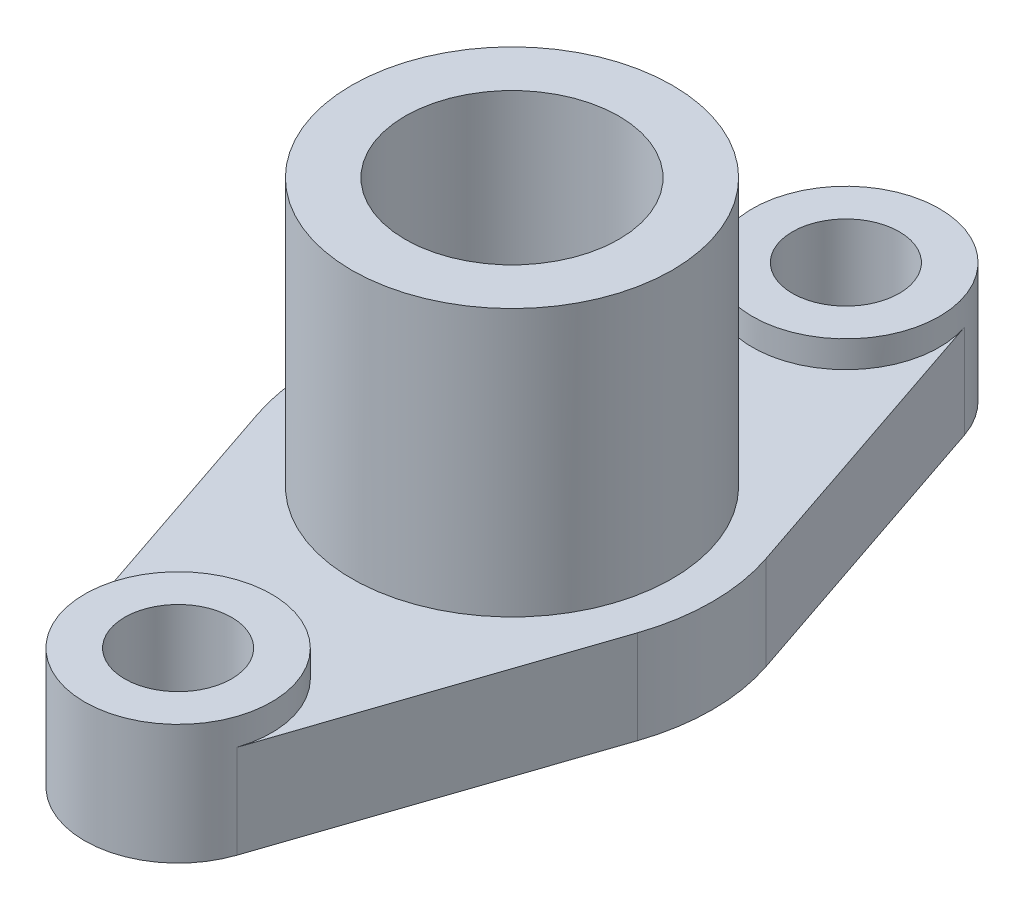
ISO-10303-21;
HEADER;
FILE_DESCRIPTION(('STEP AP214'),'2;1');
FILE_NAME('part.step','',(''),(''),'','','');
FILE_SCHEMA(('AUTOMOTIVE_DESIGN { 1 0 10303 214 1 1 1 1 }'));
ENDSEC;
DATA;
#1=APPLICATION_CONTEXT('core data for automotive mechanical design processes');
#2=APPLICATION_PROTOCOL_DEFINITION('international standard','automotive_design',2000,#1);
#3=PRODUCT_CONTEXT('',#1,'mechanical');
#4=PRODUCT('Part','Part','',(#3));
#5=PRODUCT_RELATED_PRODUCT_CATEGORY('part','',(#4));
#6=PRODUCT_DEFINITION_FORMATION('','',#4);
#7=PRODUCT_DEFINITION_CONTEXT('part definition',#1,'design');
#8=PRODUCT_DEFINITION('design','',#6,#7);
#9=PRODUCT_DEFINITION_SHAPE('','',#8);
#10=(LENGTH_UNIT() NAMED_UNIT(*) SI_UNIT(.MILLI.,.METRE.));
#11=(NAMED_UNIT(*) PLANE_ANGLE_UNIT() SI_UNIT($,.RADIAN.));
#12=(NAMED_UNIT(*) SI_UNIT($,.STERADIAN.) SOLID_ANGLE_UNIT());
#13=UNCERTAINTY_MEASURE_WITH_UNIT(LENGTH_MEASURE(1.E-05),#10,'distance_accuracy_value','');
#14=(GEOMETRIC_REPRESENTATION_CONTEXT(3) GLOBAL_UNCERTAINTY_ASSIGNED_CONTEXT((#13)) GLOBAL_UNIT_ASSIGNED_CONTEXT((#10,
#11,#12)) REPRESENTATION_CONTEXT('',''));
#15=CARTESIAN_POINT('',(0.,0.,0.));
#16=DIRECTION('',(0.,0.,1.));
#17=DIRECTION('',(1.,0.,0.));
#18=AXIS2_PLACEMENT_3D('',#15,#16,#17);
#19=CARTESIAN_POINT('',(0.,7.,0.));
#20=DIRECTION('',(0.,-1.,0.));
#21=DIRECTION('',(0.,0.,-1.));
#22=AXIS2_PLACEMENT_3D('',#19,#20,#21);
#23=PLANE('',#22);
#24=CARTESIAN_POINT('',(0.,7.,0.));
#25=DIRECTION('',(0.,-1.,0.));
#26=DIRECTION('',(0.,0.,-1.));
#27=AXIS2_PLACEMENT_3D('',#24,#25,#26);
#28=CIRCLE('',#27,12.);
#29=CARTESIAN_POINT('',(0.,7.,-12.));
#30=VERTEX_POINT('',#29);
#31=EDGE_CURVE('E11',#30,#30,#28,.T.);
#32=ORIENTED_EDGE('',*,*,#31,.T.);
#33=EDGE_LOOP('',(#32));
#34=FACE_BOUND('',#33,.T.);
#35=CARTESIAN_POINT('',(0.,7.,-25.));
#36=DIRECTION('',(0.,1.,0.));
#37=DIRECTION('',(0.,0.,1.));
#38=AXIS2_PLACEMENT_3D('',#35,#36,#37);
#39=CIRCLE('',#38,7.);
#40=CARTESIAN_POINT('',(-6.63192157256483,7.,-27.2400036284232));
#41=VERTEX_POINT('',#40);
#42=CARTESIAN_POINT('',(6.63192157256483,7.,-27.2400036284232));
#43=VERTEX_POINT('',#42);
#44=EDGE_CURVE('E55',#41,#43,#39,.T.);
#45=ORIENTED_EDGE('',*,*,#44,.F.);
#46=DIRECTION('',(0.320000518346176,0.,-0.947417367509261));
#47=VECTOR('',#46,1.);
#48=CARTESIAN_POINT('',(-14.2112727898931,7.,-4.80001192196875));
#49=LINE('',#48,#47);
#50=CARTESIAN_POINT('',(-14.2112727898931,7.,-4.80001192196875));
#51=VERTEX_POINT('',#50);
#52=EDGE_CURVE('E100',#51,#41,#49,.T.);
#53=ORIENTED_EDGE('',*,*,#52,.F.);
#54=CARTESIAN_POINT('',(0.,7.,0.));
#55=DIRECTION('',(0.,-1.,0.));
#56=DIRECTION('',(0.,0.,-1.));
#57=AXIS2_PLACEMENT_3D('',#54,#55,#56);
#58=CIRCLE('',#57,15.0000129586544);
#59=CARTESIAN_POINT('',(-14.2112727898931,7.,4.80001192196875));
#60=VERTEX_POINT('',#59);
#61=EDGE_CURVE('E120',#60,#51,#58,.T.);
#62=ORIENTED_EDGE('',*,*,#61,.F.);
#63=DIRECTION('',(-0.320000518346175,0.,-0.947417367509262));
#64=VECTOR('',#63,1.);
#65=CARTESIAN_POINT('',(-6.63192157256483,7.,27.2400036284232));
#66=LINE('',#65,#64);
#67=CARTESIAN_POINT('',(-6.63192157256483,7.,27.2400036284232));
#68=VERTEX_POINT('',#67);
#69=EDGE_CURVE('E124',#68,#60,#66,.T.);
#70=ORIENTED_EDGE('',*,*,#69,.F.);
#71=CARTESIAN_POINT('',(0.,7.,25.));
#72=DIRECTION('',(0.,1.,0.));
#73=DIRECTION('',(0.,0.,1.));
#74=AXIS2_PLACEMENT_3D('',#71,#72,#73);
#75=CIRCLE('',#74,7.);
#76=CARTESIAN_POINT('',(6.63192157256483,7.,27.2400036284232));
#77=VERTEX_POINT('',#76);
#78=EDGE_CURVE('E337',#77,#68,#75,.T.);
#79=ORIENTED_EDGE('',*,*,#78,.F.);
#80=DIRECTION('',(-0.320000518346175,0.,0.947417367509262));
#81=VECTOR('',#80,1.);
#82=CARTESIAN_POINT('',(14.2112727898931,7.,4.80001192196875));
#83=LINE('',#82,#81);
#84=CARTESIAN_POINT('',(14.2112727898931,7.,4.80001192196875));
#85=VERTEX_POINT('',#84);
#86=EDGE_CURVE('E371',#85,#77,#83,.T.);
#87=ORIENTED_EDGE('',*,*,#86,.F.);
#88=CARTESIAN_POINT('',(0.,7.,0.));
#89=DIRECTION('',(0.,-1.,0.));
#90=DIRECTION('',(0.,0.,-1.));
#91=AXIS2_PLACEMENT_3D('',#88,#89,#90);
#92=CIRCLE('',#91,15.0000129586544);
#93=CARTESIAN_POINT('',(14.2112727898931,7.,-4.80001192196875));
#94=VERTEX_POINT('',#93);
#95=EDGE_CURVE('E369',#94,#85,#92,.T.);
#96=ORIENTED_EDGE('',*,*,#95,.F.);
#97=DIRECTION('',(0.320000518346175,0.,0.947417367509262));
#98=VECTOR('',#97,1.);
#99=CARTESIAN_POINT('',(14.2112727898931,7.,-4.80001192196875));
#100=LINE('',#99,#98);
#101=EDGE_CURVE('E103',#43,#94,#100,.T.);
#102=ORIENTED_EDGE('',*,*,#101,.F.);
#103=EDGE_LOOP('',(#45,#53,#62,#70,#79,#87,#96,#102));
#104=FACE_BOUND('',#103,.T.);
#105=ADVANCED_FACE('F31',(#34,#104),#23,.F.);
#106=CARTESIAN_POINT('',(0.,27.,0.));
#107=DIRECTION('',(0.,-1.,0.));
#108=DIRECTION('',(0.,0.,-1.));
#109=AXIS2_PLACEMENT_3D('',#106,#107,#108);
#110=CYLINDRICAL_SURFACE('',#109,12.);
#111=CARTESIAN_POINT('',(0.,27.,0.));
#112=DIRECTION('',(0.,1.,0.));
#113=DIRECTION('',(0.,0.,1.));
#114=AXIS2_PLACEMENT_3D('',#111,#112,#113);
#115=CIRCLE('',#114,12.);
#116=CARTESIAN_POINT('',(0.,27.,12.));
#117=VERTEX_POINT('',#116);
#118=EDGE_CURVE('E35',#117,#117,#115,.T.);
#119=ORIENTED_EDGE('',*,*,#118,.F.);
#120=EDGE_LOOP('',(#119));
#121=FACE_BOUND('',#120,.T.);
#122=ORIENTED_EDGE('',*,*,#31,.F.);
#123=EDGE_LOOP('',(#122));
#124=FACE_BOUND('',#123,.T.);
#125=ADVANCED_FACE('F33',(#121,#124),#110,.T.);
#126=CARTESIAN_POINT('',(0.,27.,0.));
#127=DIRECTION('',(0.,1.,0.));
#128=DIRECTION('',(0.,0.,1.));
#129=AXIS2_PLACEMENT_3D('',#126,#127,#128);
#130=PLANE('',#129);
#131=ORIENTED_EDGE('',*,*,#118,.T.);
#132=EDGE_LOOP('',(#131));
#133=FACE_BOUND('',#132,.T.);
#134=CARTESIAN_POINT('',(0.,27.,0.));
#135=DIRECTION('',(0.,1.,0.));
#136=DIRECTION('',(0.,0.,1.));
#137=AXIS2_PLACEMENT_3D('',#134,#135,#136);
#138=CIRCLE('',#137,8.);
#139=CARTESIAN_POINT('',(0.,27.,8.));
#140=VERTEX_POINT('',#139);
#141=EDGE_CURVE('E140',#140,#140,#138,.T.);
#142=ORIENTED_EDGE('',*,*,#141,.F.);
#143=EDGE_LOOP('',(#142));
#144=FACE_BOUND('',#143,.T.);
#145=ADVANCED_FACE('F147',(#133,#144),#130,.T.);
#146=CARTESIAN_POINT('',(0.,0.,0.));
#147=DIRECTION('',(0.,1.,0.));
#148=DIRECTION('',(0.,0.,1.));
#149=AXIS2_PLACEMENT_3D('',#146,#147,#148);
#150=PLANE('',#149);
#151=CARTESIAN_POINT('',(0.,0.,0.));
#152=DIRECTION('',(0.,1.,0.));
#153=DIRECTION('',(0.,0.,1.));
#154=AXIS2_PLACEMENT_3D('',#151,#152,#153);
#155=CIRCLE('',#154,8.);
#156=CARTESIAN_POINT('',(0.,0.,8.));
#157=VERTEX_POINT('',#156);
#158=EDGE_CURVE('E129',#157,#157,#155,.T.);
#159=ORIENTED_EDGE('',*,*,#158,.T.);
#160=EDGE_LOOP('',(#159));
#161=FACE_BOUND('',#160,.T.);
#162=CARTESIAN_POINT('',(0.,0.,0.));
#163=DIRECTION('',(0.,-1.,0.));
#164=DIRECTION('',(0.,0.,-1.));
#165=AXIS2_PLACEMENT_3D('',#162,#163,#164);
#166=CIRCLE('',#165,15.0000129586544);
#167=CARTESIAN_POINT('',(14.2112727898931,0.,-4.80001192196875));
#168=VERTEX_POINT('',#167);
#169=CARTESIAN_POINT('',(14.2112727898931,0.,4.80001192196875));
#170=VERTEX_POINT('',#169);
#171=EDGE_CURVE('E348',#168,#170,#166,.T.);
#172=ORIENTED_EDGE('',*,*,#171,.T.);
#173=DIRECTION('',(-0.320000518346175,0.,0.947417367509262));
#174=VECTOR('',#173,1.);
#175=CARTESIAN_POINT('',(14.2112727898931,0.,4.80001192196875));
#176=LINE('',#175,#174);
#177=CARTESIAN_POINT('',(6.63192157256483,0.,27.2400036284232));
#178=VERTEX_POINT('',#177);
#179=EDGE_CURVE('E351',#170,#178,#176,.T.);
#180=ORIENTED_EDGE('',*,*,#179,.T.);
#181=CARTESIAN_POINT('',(0.,0.,25.));
#182=DIRECTION('',(0.,-1.,0.));
#183=DIRECTION('',(0.,0.,-1.));
#184=AXIS2_PLACEMENT_3D('',#181,#182,#183);
#185=CIRCLE('',#184,7.);
#186=CARTESIAN_POINT('',(-6.63192157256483,0.,27.2400036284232));
#187=VERTEX_POINT('',#186);
#188=EDGE_CURVE('E354',#178,#187,#185,.T.);
#189=ORIENTED_EDGE('',*,*,#188,.T.);
#190=DIRECTION('',(-0.320000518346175,0.,-0.947417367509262));
#191=VECTOR('',#190,1.);
#192=CARTESIAN_POINT('',(-6.63192157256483,0.,27.2400036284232));
#193=LINE('',#192,#191);
#194=CARTESIAN_POINT('',(-14.2112727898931,0.,4.80001192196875));
#195=VERTEX_POINT('',#194);
#196=EDGE_CURVE('E357',#187,#195,#193,.T.);
#197=ORIENTED_EDGE('',*,*,#196,.T.);
#198=CARTESIAN_POINT('',(0.,0.,0.));
#199=DIRECTION('',(0.,-1.,0.));
#200=DIRECTION('',(0.,0.,-1.));
#201=AXIS2_PLACEMENT_3D('',#198,#199,#200);
#202=CIRCLE('',#201,15.0000129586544);
#203=CARTESIAN_POINT('',(-14.2112727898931,0.,-4.80001192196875));
#204=VERTEX_POINT('',#203);
#205=EDGE_CURVE('E360',#195,#204,#202,.T.);
#206=ORIENTED_EDGE('',*,*,#205,.T.);
#207=DIRECTION('',(0.320000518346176,0.,-0.947417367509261));
#208=VECTOR('',#207,1.);
#209=CARTESIAN_POINT('',(-14.2112727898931,0.,-4.80001192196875));
#210=LINE('',#209,#208);
#211=CARTESIAN_POINT('',(-6.63192157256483,0.,-27.2400036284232));
#212=VERTEX_POINT('',#211);
#213=EDGE_CURVE('E363',#204,#212,#210,.T.);
#214=ORIENTED_EDGE('',*,*,#213,.T.);
#215=CARTESIAN_POINT('',(0.,0.,-25.));
#216=DIRECTION('',(0.,-1.,0.));
#217=DIRECTION('',(0.,0.,-1.));
#218=AXIS2_PLACEMENT_3D('',#215,#216,#217);
#219=CIRCLE('',#218,7.);
#220=CARTESIAN_POINT('',(6.63192157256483,0.,-27.2400036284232));
#221=VERTEX_POINT('',#220);
#222=EDGE_CURVE('E112',#212,#221,#219,.T.);
#223=ORIENTED_EDGE('',*,*,#222,.T.);
#224=DIRECTION('',(0.320000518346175,0.,0.947417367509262));
#225=VECTOR('',#224,1.);
#226=CARTESIAN_POINT('',(14.2112727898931,0.,-4.80001192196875));
#227=LINE('',#226,#225);
#228=EDGE_CURVE('E366',#221,#168,#227,.T.);
#229=ORIENTED_EDGE('',*,*,#228,.T.);
#230=EDGE_LOOP('',(#172,#180,#189,#197,#206,#214,#223,#229));
#231=FACE_BOUND('',#230,.T.);
#232=CARTESIAN_POINT('',(0.,0.,-25.));
#233=DIRECTION('',(0.,-1.,0.));
#234=DIRECTION('',(0.,0.,-1.));
#235=AXIS2_PLACEMENT_3D('',#232,#233,#234);
#236=CIRCLE('',#235,4.);
#237=CARTESIAN_POINT('',(0.,0.,-29.));
#238=VERTEX_POINT('',#237);
#239=EDGE_CURVE('E345',#238,#238,#236,.T.);
#240=ORIENTED_EDGE('',*,*,#239,.F.);
#241=EDGE_LOOP('',(#240));
#242=FACE_BOUND('',#241,.T.);
#243=CARTESIAN_POINT('',(0.,0.,25.));
#244=DIRECTION('',(0.,-1.,0.));
#245=DIRECTION('',(0.,0.,-1.));
#246=AXIS2_PLACEMENT_3D('',#243,#244,#245);
#247=CIRCLE('',#246,4.);
#248=CARTESIAN_POINT('',(0.,0.,21.));
#249=VERTEX_POINT('',#248);
#250=EDGE_CURVE('E341',#249,#249,#247,.T.);
#251=ORIENTED_EDGE('',*,*,#250,.F.);
#252=EDGE_LOOP('',(#251));
#253=FACE_BOUND('',#252,.T.);
#254=ADVANCED_FACE('F192',(#161,#231,#242,#253),#150,.F.);
#255=CARTESIAN_POINT('',(0.,27.,0.));
#256=DIRECTION('',(0.,-1.,0.));
#257=DIRECTION('',(0.,0.,-1.));
#258=AXIS2_PLACEMENT_3D('',#255,#256,#257);
#259=CYLINDRICAL_SURFACE('',#258,8.);
#260=ORIENTED_EDGE('',*,*,#158,.F.);
#261=EDGE_LOOP('',(#260));
#262=FACE_BOUND('',#261,.T.);
#263=ORIENTED_EDGE('',*,*,#141,.T.);
#264=EDGE_LOOP('',(#263));
#265=FACE_BOUND('',#264,.T.);
#266=ADVANCED_FACE('F189',(#262,#265),#259,.F.);
#267=CARTESIAN_POINT('',(0.,7.,0.));
#268=DIRECTION('',(0.,-1.,0.));
#269=DIRECTION('',(0.,0.,-1.));
#270=AXIS2_PLACEMENT_3D('',#267,#268,#269);
#271=CYLINDRICAL_SURFACE('',#270,15.0000129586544);
#272=ORIENTED_EDGE('',*,*,#171,.F.);
#273=DIRECTION('',(0.,-1.,0.));
#274=VECTOR('',#273,1.);
#275=CARTESIAN_POINT('',(14.2112727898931,7.,-4.80001192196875));
#276=LINE('',#275,#274);
#277=EDGE_CURVE('E47',#94,#168,#276,.T.);
#278=ORIENTED_EDGE('',*,*,#277,.F.);
#279=ORIENTED_EDGE('',*,*,#95,.T.);
#280=DIRECTION('',(0.,-1.,0.));
#281=VECTOR('',#280,1.);
#282=CARTESIAN_POINT('',(14.2112727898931,7.,4.80001192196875));
#283=LINE('',#282,#281);
#284=EDGE_CURVE('E122',#85,#170,#283,.T.);
#285=ORIENTED_EDGE('',*,*,#284,.T.);
#286=EDGE_LOOP('',(#272,#278,#279,#285));
#287=FACE_BOUND('',#286,.T.);
#288=ADVANCED_FACE('F165',(#287),#271,.T.);
#289=CARTESIAN_POINT('',(14.2112727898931,7.,-4.80001192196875));
#290=DIRECTION('',(0.947417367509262,0.,-0.320000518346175));
#291=DIRECTION('',(-0.320000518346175,0.,-0.947417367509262));
#292=AXIS2_PLACEMENT_3D('',#289,#290,#291);
#293=PLANE('',#292);
#294=ORIENTED_EDGE('',*,*,#228,.F.);
#295=DIRECTION('',(0.,-1.,0.));
#296=VECTOR('',#295,1.);
#297=CARTESIAN_POINT('',(6.63192157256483,7.,-27.2400036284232));
#298=LINE('',#297,#296);
#299=EDGE_CURVE('E116',#43,#221,#298,.T.);
#300=ORIENTED_EDGE('',*,*,#299,.F.);
#301=ORIENTED_EDGE('',*,*,#101,.T.);
#302=ORIENTED_EDGE('',*,*,#277,.T.);
#303=EDGE_LOOP('',(#294,#300,#301,#302));
#304=FACE_BOUND('',#303,.T.);
#305=ADVANCED_FACE('F162',(#304),#293,.T.);
#306=CARTESIAN_POINT('',(0.,7.,-25.));
#307=DIRECTION('',(0.,-1.,0.));
#308=DIRECTION('',(0.,0.,-1.));
#309=AXIS2_PLACEMENT_3D('',#306,#307,#308);
#310=CYLINDRICAL_SURFACE('',#309,7.);
#311=ORIENTED_EDGE('',*,*,#222,.F.);
#312=DIRECTION('',(0.,-1.,0.));
#313=VECTOR('',#312,1.);
#314=CARTESIAN_POINT('',(-6.63192157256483,7.,-27.2400036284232));
#315=LINE('',#314,#313);
#316=EDGE_CURVE('E108',#41,#212,#315,.T.);
#317=ORIENTED_EDGE('',*,*,#316,.F.);
#318=ORIENTED_EDGE('',*,*,#44,.T.);
#319=ORIENTED_EDGE('',*,*,#299,.T.);
#320=EDGE_LOOP('',(#311,#317,#318,#319));
#321=FACE_BOUND('',#320,.T.);
#322=CARTESIAN_POINT('',(0.,9.,-25.));
#323=DIRECTION('',(0.,1.,0.));
#324=DIRECTION('',(0.,0.,1.));
#325=AXIS2_PLACEMENT_3D('',#322,#323,#324);
#326=CIRCLE('',#325,7.);
#327=CARTESIAN_POINT('',(0.,9.,-18.));
#328=VERTEX_POINT('',#327);
#329=EDGE_CURVE('E104',#328,#328,#326,.T.);
#330=ORIENTED_EDGE('',*,*,#329,.F.);
#331=EDGE_LOOP('',(#330));
#332=FACE_BOUND('',#331,.T.);
#333=ADVANCED_FACE('F109',(#321,#332),#310,.T.);
#334=CARTESIAN_POINT('',(-14.2112727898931,7.,-4.80001192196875));
#335=DIRECTION('',(-0.947417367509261,0.,-0.320000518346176));
#336=DIRECTION('',(-0.320000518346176,0.,0.947417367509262));
#337=AXIS2_PLACEMENT_3D('',#334,#335,#336);
#338=PLANE('',#337);
#339=ORIENTED_EDGE('',*,*,#213,.F.);
#340=DIRECTION('',(0.,-1.,0.));
#341=VECTOR('',#340,1.);
#342=CARTESIAN_POINT('',(-14.2112727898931,7.,-4.80001192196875));
#343=LINE('',#342,#341);
#344=EDGE_CURVE('E117',#51,#204,#343,.T.);
#345=ORIENTED_EDGE('',*,*,#344,.F.);
#346=ORIENTED_EDGE('',*,*,#52,.T.);
#347=ORIENTED_EDGE('',*,*,#316,.T.);
#348=EDGE_LOOP('',(#339,#345,#346,#347));
#349=FACE_BOUND('',#348,.T.);
#350=ADVANCED_FACE('F119',(#349),#338,.T.);
#351=CARTESIAN_POINT('',(0.,7.,0.));
#352=DIRECTION('',(0.,-1.,0.));
#353=DIRECTION('',(0.,0.,-1.));
#354=AXIS2_PLACEMENT_3D('',#351,#352,#353);
#355=CYLINDRICAL_SURFACE('',#354,15.0000129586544);
#356=ORIENTED_EDGE('',*,*,#205,.F.);
#357=DIRECTION('',(0.,-1.,0.));
#358=VECTOR('',#357,1.);
#359=CARTESIAN_POINT('',(-14.2112727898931,7.,4.80001192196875));
#360=LINE('',#359,#358);
#361=EDGE_CURVE('E132',#60,#195,#360,.T.);
#362=ORIENTED_EDGE('',*,*,#361,.F.);
#363=ORIENTED_EDGE('',*,*,#61,.T.);
#364=ORIENTED_EDGE('',*,*,#344,.T.);
#365=EDGE_LOOP('',(#356,#362,#363,#364));
#366=FACE_BOUND('',#365,.T.);
#367=ADVANCED_FACE('F171',(#366),#355,.T.);
#368=CARTESIAN_POINT('',(-6.63192157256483,7.,27.2400036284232));
#369=DIRECTION('',(-0.947417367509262,0.,0.320000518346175));
#370=DIRECTION('',(0.320000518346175,0.,0.947417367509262));
#371=AXIS2_PLACEMENT_3D('',#368,#369,#370);
#372=PLANE('',#371);
#373=ORIENTED_EDGE('',*,*,#196,.F.);
#374=DIRECTION('',(0.,-1.,0.));
#375=VECTOR('',#374,1.);
#376=CARTESIAN_POINT('',(-6.63192157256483,7.,27.2400036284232));
#377=LINE('',#376,#375);
#378=EDGE_CURVE('E134',#68,#187,#377,.T.);
#379=ORIENTED_EDGE('',*,*,#378,.F.);
#380=ORIENTED_EDGE('',*,*,#69,.T.);
#381=ORIENTED_EDGE('',*,*,#361,.T.);
#382=EDGE_LOOP('',(#373,#379,#380,#381));
#383=FACE_BOUND('',#382,.T.);
#384=ADVANCED_FACE('F174',(#383),#372,.T.);
#385=CARTESIAN_POINT('',(0.,7.,25.));
#386=DIRECTION('',(0.,-1.,0.));
#387=DIRECTION('',(0.,0.,-1.));
#388=AXIS2_PLACEMENT_3D('',#385,#386,#387);
#389=CYLINDRICAL_SURFACE('',#388,7.);
#390=ORIENTED_EDGE('',*,*,#188,.F.);
#391=DIRECTION('',(0.,-1.,0.));
#392=VECTOR('',#391,1.);
#393=CARTESIAN_POINT('',(6.63192157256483,7.,27.2400036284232));
#394=LINE('',#393,#392);
#395=EDGE_CURVE('E136',#77,#178,#394,.T.);
#396=ORIENTED_EDGE('',*,*,#395,.F.);
#397=ORIENTED_EDGE('',*,*,#78,.T.);
#398=ORIENTED_EDGE('',*,*,#378,.T.);
#399=EDGE_LOOP('',(#390,#396,#397,#398));
#400=FACE_BOUND('',#399,.T.);
#401=CARTESIAN_POINT('',(0.,9.,25.));
#402=DIRECTION('',(0.,1.,0.));
#403=DIRECTION('',(0.,0.,1.));
#404=AXIS2_PLACEMENT_3D('',#401,#402,#403);
#405=CIRCLE('',#404,7.);
#406=CARTESIAN_POINT('',(0.,9.,32.));
#407=VERTEX_POINT('',#406);
#408=EDGE_CURVE('E338',#407,#407,#405,.T.);
#409=ORIENTED_EDGE('',*,*,#408,.F.);
#410=EDGE_LOOP('',(#409));
#411=FACE_BOUND('',#410,.T.);
#412=ADVANCED_FACE('F178',(#400,#411),#389,.T.);
#413=CARTESIAN_POINT('',(14.2112727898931,7.,4.80001192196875));
#414=DIRECTION('',(0.947417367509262,0.,0.320000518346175));
#415=DIRECTION('',(0.320000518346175,0.,-0.947417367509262));
#416=AXIS2_PLACEMENT_3D('',#413,#414,#415);
#417=PLANE('',#416);
#418=ORIENTED_EDGE('',*,*,#179,.F.);
#419=ORIENTED_EDGE('',*,*,#284,.F.);
#420=ORIENTED_EDGE('',*,*,#86,.T.);
#421=ORIENTED_EDGE('',*,*,#395,.T.);
#422=EDGE_LOOP('',(#418,#419,#420,#421));
#423=FACE_BOUND('',#422,.T.);
#424=ADVANCED_FACE('F182',(#423),#417,.T.);
#425=CARTESIAN_POINT('',(0.,7.,-25.));
#426=DIRECTION('',(0.,-1.,0.));
#427=DIRECTION('',(0.,0.,-1.));
#428=AXIS2_PLACEMENT_3D('',#425,#426,#427);
#429=CYLINDRICAL_SURFACE('',#428,4.);
#430=ORIENTED_EDGE('',*,*,#239,.T.);
#431=EDGE_LOOP('',(#430));
#432=FACE_BOUND('',#431,.T.);
#433=CARTESIAN_POINT('',(0.,9.,-25.));
#434=DIRECTION('',(0.,1.,0.));
#435=DIRECTION('',(0.,0.,1.));
#436=AXIS2_PLACEMENT_3D('',#433,#434,#435);
#437=CIRCLE('',#436,4.);
#438=CARTESIAN_POINT('',(0.,9.,-21.));
#439=VERTEX_POINT('',#438);
#440=EDGE_CURVE('E105',#439,#439,#437,.T.);
#441=ORIENTED_EDGE('',*,*,#440,.T.);
#442=EDGE_LOOP('',(#441));
#443=FACE_BOUND('',#442,.T.);
#444=ADVANCED_FACE('F160',(#432,#443),#429,.F.);
#445=CARTESIAN_POINT('',(0.,7.,25.));
#446=DIRECTION('',(0.,-1.,0.));
#447=DIRECTION('',(0.,0.,-1.));
#448=AXIS2_PLACEMENT_3D('',#445,#446,#447);
#449=CYLINDRICAL_SURFACE('',#448,4.);
#450=ORIENTED_EDGE('',*,*,#250,.T.);
#451=EDGE_LOOP('',(#450));
#452=FACE_BOUND('',#451,.T.);
#453=CARTESIAN_POINT('',(0.,9.,25.));
#454=DIRECTION('',(0.,1.,0.));
#455=DIRECTION('',(0.,0.,1.));
#456=AXIS2_PLACEMENT_3D('',#453,#454,#455);
#457=CIRCLE('',#456,4.);
#458=CARTESIAN_POINT('',(0.,9.,29.));
#459=VERTEX_POINT('',#458);
#460=EDGE_CURVE('E333',#459,#459,#457,.T.);
#461=ORIENTED_EDGE('',*,*,#460,.T.);
#462=EDGE_LOOP('',(#461));
#463=FACE_BOUND('',#462,.T.);
#464=ADVANCED_FACE('F247',(#452,#463),#449,.F.);
#465=CARTESIAN_POINT('',(0.,9.,25.));
#466=DIRECTION('',(0.,1.,0.));
#467=DIRECTION('',(0.,0.,1.));
#468=AXIS2_PLACEMENT_3D('',#465,#466,#467);
#469=PLANE('',#468);
#470=ORIENTED_EDGE('',*,*,#408,.T.);
#471=EDGE_LOOP('',(#470));
#472=FACE_BOUND('',#471,.T.);
#473=ORIENTED_EDGE('',*,*,#460,.F.);
#474=EDGE_LOOP('',(#473));
#475=FACE_BOUND('',#474,.T.);
#476=ADVANCED_FACE('F254',(#472,#475),#469,.T.);
#477=CARTESIAN_POINT('',(0.,9.,-25.));
#478=DIRECTION('',(0.,1.,0.));
#479=DIRECTION('',(0.,0.,1.));
#480=AXIS2_PLACEMENT_3D('',#477,#478,#479);
#481=PLANE('',#480);
#482=ORIENTED_EDGE('',*,*,#329,.T.);
#483=EDGE_LOOP('',(#482));
#484=FACE_BOUND('',#483,.T.);
#485=ORIENTED_EDGE('',*,*,#440,.F.);
#486=EDGE_LOOP('',(#485));
#487=FACE_BOUND('',#486,.T.);
#488=ADVANCED_FACE('F261',(#484,#487),#481,.T.);
#489=CLOSED_SHELL('',(#105,#125,#145,#254,#266,#288,#305,#333,#350,#367,#384,#412,#424,#444,
#464,#476,#488));
#490=MANIFOLD_SOLID_BREP('B2',#489);
#491=ADVANCED_BREP_SHAPE_REPRESENTATION('',(#18,#490),#14);
#492=SHAPE_DEFINITION_REPRESENTATION(#9,#491);
ENDSEC;
END-ISO-10303-21;
